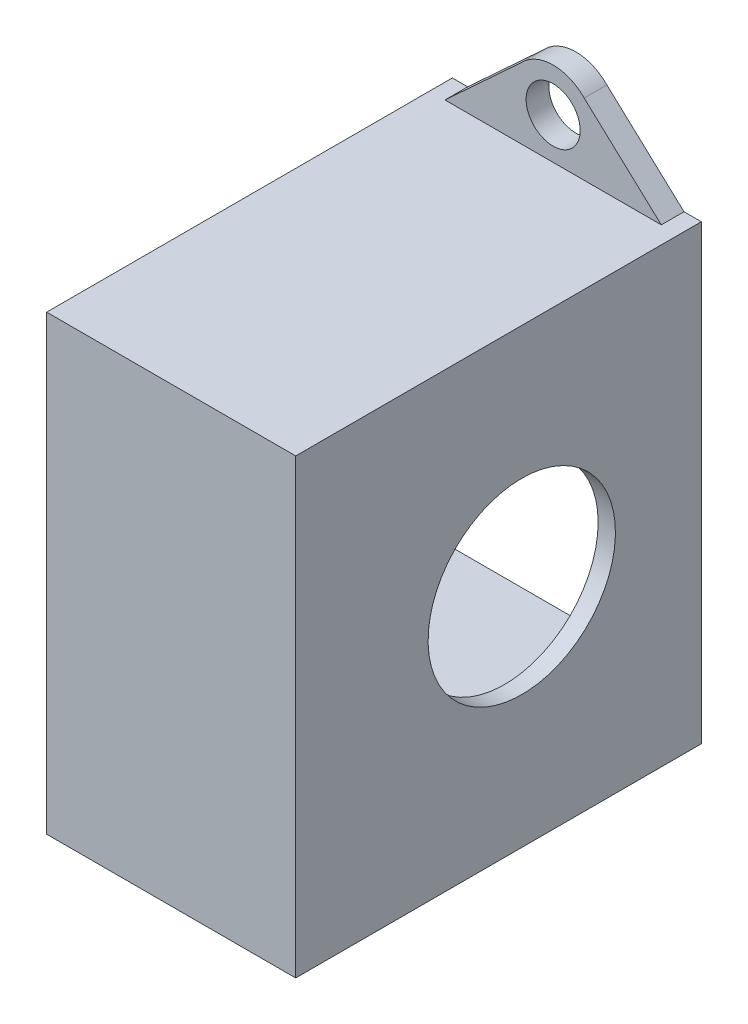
ISO-10303-21;
HEADER;
FILE_DESCRIPTION(('STEP AP214'),'2;1');
FILE_NAME('part.step','',(''),(''),'','','');
FILE_SCHEMA(('AUTOMOTIVE_DESIGN { 1 0 10303 214 1 1 1 1 }'));
ENDSEC;
DATA;
#1=APPLICATION_CONTEXT('core data for automotive mechanical design processes');
#2=APPLICATION_PROTOCOL_DEFINITION('international standard','automotive_design',2000,#1);
#3=PRODUCT_CONTEXT('',#1,'mechanical');
#4=PRODUCT('Part','Part','',(#3));
#5=PRODUCT_RELATED_PRODUCT_CATEGORY('part','',(#4));
#6=PRODUCT_DEFINITION_FORMATION('','',#4);
#7=PRODUCT_DEFINITION_CONTEXT('part definition',#1,'design');
#8=PRODUCT_DEFINITION('design','',#6,#7);
#9=PRODUCT_DEFINITION_SHAPE('','',#8);
#10=(LENGTH_UNIT() NAMED_UNIT(*) SI_UNIT(.MILLI.,.METRE.));
#11=(NAMED_UNIT(*) PLANE_ANGLE_UNIT() SI_UNIT($,.RADIAN.));
#12=(NAMED_UNIT(*) SI_UNIT($,.STERADIAN.) SOLID_ANGLE_UNIT());
#13=UNCERTAINTY_MEASURE_WITH_UNIT(LENGTH_MEASURE(1.E-05),#10,'distance_accuracy_value','');
#14=(GEOMETRIC_REPRESENTATION_CONTEXT(3) GLOBAL_UNCERTAINTY_ASSIGNED_CONTEXT((#13)) GLOBAL_UNIT_ASSIGNED_CONTEXT((#10,
#11,#12)) REPRESENTATION_CONTEXT('',''));
#15=CARTESIAN_POINT('',(0.,0.,0.));
#16=DIRECTION('',(0.,0.,1.));
#17=DIRECTION('',(1.,0.,0.));
#18=AXIS2_PLACEMENT_3D('',#15,#16,#17);
#19=CARTESIAN_POINT('',(-743.540723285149,404.269107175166,5.334));
#20=DIRECTION('',(0.,-1.,0.));
#21=DIRECTION('',(0.,0.,-1.));
#22=AXIS2_PLACEMENT_3D('',#19,#20,#21);
#23=PLANE('',#22);
#24=DIRECTION('',(-1.,0.,0.));
#25=VECTOR('',#24,1.);
#26=CARTESIAN_POINT('',(-743.540723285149,404.269107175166,5.334));
#27=LINE('',#26,#25);
#28=CARTESIAN_POINT('',(-741.508723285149,404.269107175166,5.334));
#29=VERTEX_POINT('',#28);
#30=CARTESIAN_POINT('',(-770.747609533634,404.269107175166,5.334));
#31=VERTEX_POINT('',#30);
#32=EDGE_CURVE('E148',#29,#31,#27,.T.);
#33=ORIENTED_EDGE('',*,*,#32,.F.);
#34=DIRECTION('',(0.,0.,1.));
#35=VECTOR('',#34,1.);
#36=CARTESIAN_POINT('',(-741.508723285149,404.269107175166,5.334));
#37=LINE('',#36,#35);
#38=CARTESIAN_POINT('',(-741.508723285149,404.269107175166,-42.2909999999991));
#39=VERTEX_POINT('',#38);
#40=EDGE_CURVE('E152',#39,#29,#37,.T.);
#41=ORIENTED_EDGE('',*,*,#40,.F.);
#42=DIRECTION('',(-1.,0.,0.));
#43=VECTOR('',#42,1.);
#44=CARTESIAN_POINT('',(-670.190674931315,404.269107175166,-42.2909999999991));
#45=LINE('',#44,#43);
#46=CARTESIAN_POINT('',(-743.540723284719,404.269107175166,-42.2909999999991));
#47=VERTEX_POINT('',#46);
#48=EDGE_CURVE('E186',#39,#47,#45,.T.);
#49=ORIENTED_EDGE('',*,*,#48,.T.);
#50=DIRECTION('',(0.,0.,-1.));
#51=VECTOR('',#50,1.);
#52=CARTESIAN_POINT('',(-743.540723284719,404.269107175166,-39.6239999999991));
#53=LINE('',#52,#51);
#54=CARTESIAN_POINT('',(-743.540723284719,404.269107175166,-39.6239999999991));
#55=VERTEX_POINT('',#54);
#56=EDGE_CURVE('E259',#55,#47,#53,.T.);
#57=ORIENTED_EDGE('',*,*,#56,.F.);
#58=DIRECTION('',(-1.,0.,0.));
#59=VECTOR('',#58,1.);
#60=CARTESIAN_POINT('',(-743.540723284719,404.269107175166,-39.6239999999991));
#61=LINE('',#60,#59);
#62=CARTESIAN_POINT('',(-768.94072328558,404.269107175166,-39.6239999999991));
#63=VERTEX_POINT('',#62);
#64=EDGE_CURVE('E277',#55,#63,#61,.T.);
#65=ORIENTED_EDGE('',*,*,#64,.T.);
#66=DIRECTION('',(0.,0.,-1.));
#67=VECTOR('',#66,1.);
#68=CARTESIAN_POINT('',(-768.94072328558,404.269107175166,-39.6239999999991));
#69=LINE('',#68,#67);
#70=CARTESIAN_POINT('',(-768.94072328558,404.269107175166,-42.2909999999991));
#71=VERTEX_POINT('',#70);
#72=EDGE_CURVE('E255',#63,#71,#69,.T.);
#73=ORIENTED_EDGE('',*,*,#72,.T.);
#74=DIRECTION('',(-1.,0.,0.));
#75=VECTOR('',#74,1.);
#76=CARTESIAN_POINT('',(-770.747609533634,404.269107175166,-42.2909999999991));
#77=LINE('',#76,#75);
#78=CARTESIAN_POINT('',(-770.747609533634,404.269107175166,-42.2909999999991));
#79=VERTEX_POINT('',#78);
#80=EDGE_CURVE('E243',#71,#79,#77,.T.);
#81=ORIENTED_EDGE('',*,*,#80,.T.);
#82=DIRECTION('',(0.,0.,-1.));
#83=VECTOR('',#82,1.);
#84=CARTESIAN_POINT('',(-770.747609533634,404.269107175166,5.334));
#85=LINE('',#84,#83);
#86=EDGE_CURVE('E155',#31,#79,#85,.T.);
#87=ORIENTED_EDGE('',*,*,#86,.F.);
#88=EDGE_LOOP('',(#33,#41,#49,#57,#65,#73,#81,#87));
#89=FACE_BOUND('',#88,.T.);
#90=ADVANCED_FACE('F33',(#89),#23,.F.);
#91=CARTESIAN_POINT('',(-770.747609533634,404.269107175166,5.334));
#92=DIRECTION('',(1.,0.,0.));
#93=DIRECTION('',(0.,0.,-1.));
#94=AXIS2_PLACEMENT_3D('',#91,#92,#93);
#95=PLANE('',#94);
#96=DIRECTION('',(0.,-1.,0.));
#97=VECTOR('',#96,1.);
#98=CARTESIAN_POINT('',(-770.747609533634,404.269107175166,0.));
#99=LINE('',#98,#97);
#100=CARTESIAN_POINT('',(-770.747609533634,398.935107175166,0.));
#101=VERTEX_POINT('',#100);
#102=CARTESIAN_POINT('',(-770.747609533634,356.517107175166,0.));
#103=VERTEX_POINT('',#102);
#104=EDGE_CURVE('E371',#101,#103,#99,.T.);
#105=ORIENTED_EDGE('',*,*,#104,.T.);
#106=DIRECTION('',(0.,0.,1.));
#107=VECTOR('',#106,1.);
#108=CARTESIAN_POINT('',(-770.747609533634,356.517107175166,5.334));
#109=LINE('',#108,#107);
#110=CARTESIAN_POINT('',(-770.747609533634,356.517107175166,-42.2909999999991));
#111=VERTEX_POINT('',#110);
#112=EDGE_CURVE('E288',#111,#103,#109,.T.);
#113=ORIENTED_EDGE('',*,*,#112,.F.);
#114=DIRECTION('',(0.,-1.,0.));
#115=VECTOR('',#114,1.);
#116=CARTESIAN_POINT('',(-770.747609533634,356.517107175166,-42.2909999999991));
#117=LINE('',#116,#115);
#118=CARTESIAN_POINT('',(-770.747609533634,351.183107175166,-42.2909999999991));
#119=VERTEX_POINT('',#118);
#120=EDGE_CURVE('E281',#111,#119,#117,.T.);
#121=ORIENTED_EDGE('',*,*,#120,.T.);
#122=DIRECTION('',(0.,0.,-1.));
#123=VECTOR('',#122,1.);
#124=CARTESIAN_POINT('',(-770.747609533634,351.183107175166,5.334));
#125=LINE('',#124,#123);
#126=CARTESIAN_POINT('',(-770.747609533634,351.183107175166,5.334));
#127=VERTEX_POINT('',#126);
#128=EDGE_CURVE('E158',#127,#119,#125,.T.);
#129=ORIENTED_EDGE('',*,*,#128,.F.);
#130=DIRECTION('',(0.,-1.,0.));
#131=VECTOR('',#130,1.);
#132=CARTESIAN_POINT('',(-770.747609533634,404.269107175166,5.334));
#133=LINE('',#132,#131);
#134=EDGE_CURVE('E159',#31,#127,#133,.T.);
#135=ORIENTED_EDGE('',*,*,#134,.F.);
#136=ORIENTED_EDGE('',*,*,#86,.T.);
#137=DIRECTION('',(0.,1.,0.));
#138=VECTOR('',#137,1.);
#139=CARTESIAN_POINT('',(-770.747609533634,398.935107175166,-42.2909999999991));
#140=LINE('',#139,#138);
#141=CARTESIAN_POINT('',(-770.747609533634,398.935107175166,-42.2909999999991));
#142=VERTEX_POINT('',#141);
#143=EDGE_CURVE('E225',#142,#79,#140,.T.);
#144=ORIENTED_EDGE('',*,*,#143,.F.);
#145=DIRECTION('',(0.,0.,1.));
#146=VECTOR('',#145,1.);
#147=CARTESIAN_POINT('',(-770.747609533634,398.935107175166,5.334));
#148=LINE('',#147,#146);
#149=EDGE_CURVE('E232',#142,#101,#148,.T.);
#150=ORIENTED_EDGE('',*,*,#149,.T.);
#151=EDGE_LOOP('',(#105,#113,#121,#129,#135,#136,#144,#150));
#152=FACE_BOUND('',#151,.T.);
#153=ADVANCED_FACE('F343',(#152),#95,.F.);
#154=CARTESIAN_POINT('',(-743.540723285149,351.183107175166,5.334));
#155=DIRECTION('',(0.,-1.,0.));
#156=DIRECTION('',(0.,0.,-1.));
#157=AXIS2_PLACEMENT_3D('',#154,#155,#156);
#158=PLANE('',#157);
#159=DIRECTION('',(0.,0.,-1.));
#160=VECTOR('',#159,1.);
#161=CARTESIAN_POINT('',(-768.94072328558,351.183107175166,-39.6239999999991));
#162=LINE('',#161,#160);
#163=CARTESIAN_POINT('',(-768.94072328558,351.183107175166,-39.6239999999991));
#164=VERTEX_POINT('',#163);
#165=CARTESIAN_POINT('',(-768.94072328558,351.183107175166,-42.2909999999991));
#166=VERTEX_POINT('',#165);
#167=EDGE_CURVE('E213',#164,#166,#162,.T.);
#168=ORIENTED_EDGE('',*,*,#167,.F.);
#169=DIRECTION('',(-1.,0.,0.));
#170=VECTOR('',#169,1.);
#171=CARTESIAN_POINT('',(-743.540723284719,351.183107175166,-39.6239999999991));
#172=LINE('',#171,#170);
#173=CARTESIAN_POINT('',(-743.540723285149,351.183107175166,-39.6239999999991));
#174=VERTEX_POINT('',#173);
#175=EDGE_CURVE('E50',#174,#164,#172,.T.);
#176=ORIENTED_EDGE('',*,*,#175,.F.);
#177=DIRECTION('',(0.,0.,-1.));
#178=VECTOR('',#177,1.);
#179=CARTESIAN_POINT('',(-743.540723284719,351.183107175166,-39.6239999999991));
#180=LINE('',#179,#178);
#181=CARTESIAN_POINT('',(-743.540723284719,351.183107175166,-42.2909999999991));
#182=VERTEX_POINT('',#181);
#183=EDGE_CURVE('E216',#174,#182,#180,.T.);
#184=ORIENTED_EDGE('',*,*,#183,.T.);
#185=DIRECTION('',(-1.,0.,0.));
#186=VECTOR('',#185,1.);
#187=CARTESIAN_POINT('',(-670.190674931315,351.183107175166,-42.2909999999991));
#188=LINE('',#187,#186);
#189=CARTESIAN_POINT('',(-741.508723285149,351.183107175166,-42.2909999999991));
#190=VERTEX_POINT('',#189);
#191=EDGE_CURVE('E198',#190,#182,#188,.T.);
#192=ORIENTED_EDGE('',*,*,#191,.F.);
#193=DIRECTION('',(0.,0.,-1.));
#194=VECTOR('',#193,1.);
#195=CARTESIAN_POINT('',(-741.508723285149,351.183107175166,5.334));
#196=LINE('',#195,#194);
#197=CARTESIAN_POINT('',(-741.508723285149,351.183107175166,5.334));
#198=VERTEX_POINT('',#197);
#199=EDGE_CURVE('E170',#198,#190,#196,.T.);
#200=ORIENTED_EDGE('',*,*,#199,.F.);
#201=DIRECTION('',(-1.,0.,0.));
#202=VECTOR('',#201,1.);
#203=CARTESIAN_POINT('',(-743.540723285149,351.183107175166,5.334));
#204=LINE('',#203,#202);
#205=EDGE_CURVE('E165',#198,#127,#204,.T.);
#206=ORIENTED_EDGE('',*,*,#205,.T.);
#207=ORIENTED_EDGE('',*,*,#128,.T.);
#208=DIRECTION('',(-1.,0.,0.));
#209=VECTOR('',#208,1.);
#210=CARTESIAN_POINT('',(-770.747609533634,351.183107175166,-42.2909999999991));
#211=LINE('',#210,#209);
#212=EDGE_CURVE('E56',#166,#119,#211,.T.);
#213=ORIENTED_EDGE('',*,*,#212,.F.);
#214=EDGE_LOOP('',(#168,#176,#184,#192,#200,#206,#207,#213));
#215=FACE_BOUND('',#214,.T.);
#216=ADVANCED_FACE('F35',(#215),#158,.T.);
#217=CARTESIAN_POINT('',(0.,0.,5.334));
#218=DIRECTION('',(0.,0.,-1.));
#219=DIRECTION('',(-1.,0.,0.));
#220=AXIS2_PLACEMENT_3D('',#217,#218,#219);
#221=PLANE('',#220);
#222=ORIENTED_EDGE('',*,*,#134,.T.);
#223=ORIENTED_EDGE('',*,*,#205,.F.);
#224=DIRECTION('',(0.,-1.,0.));
#225=VECTOR('',#224,1.);
#226=CARTESIAN_POINT('',(-741.508723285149,404.269107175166,5.334));
#227=LINE('',#226,#225);
#228=EDGE_CURVE('E162',#29,#198,#227,.T.);
#229=ORIENTED_EDGE('',*,*,#228,.F.);
#230=ORIENTED_EDGE('',*,*,#32,.T.);
#231=EDGE_LOOP('',(#222,#223,#229,#230));
#232=FACE_BOUND('',#231,.T.);
#233=ADVANCED_FACE('F163',(#232),#221,.F.);
#234=CARTESIAN_POINT('',(0.,0.,0.));
#235=DIRECTION('',(0.,0.,-1.));
#236=DIRECTION('',(-1.,0.,0.));
#237=AXIS2_PLACEMENT_3D('',#234,#235,#236);
#238=PLANE('',#237);
#239=DIRECTION('',(1.,0.,0.));
#240=VECTOR('',#239,1.);
#241=CARTESIAN_POINT('',(0.,356.517107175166,0.));
#242=LINE('',#241,#240);
#243=CARTESIAN_POINT('',(-743.540723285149,356.517107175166,0.));
#244=VERTEX_POINT('',#243);
#245=EDGE_CURVE('E11',#103,#244,#242,.T.);
#246=ORIENTED_EDGE('',*,*,#245,.F.);
#247=ORIENTED_EDGE('',*,*,#104,.F.);
#248=DIRECTION('',(-1.,0.,0.));
#249=VECTOR('',#248,1.);
#250=CARTESIAN_POINT('',(0.,398.935107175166,0.));
#251=LINE('',#250,#249);
#252=CARTESIAN_POINT('',(-743.540723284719,398.935107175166,0.));
#253=VERTEX_POINT('',#252);
#254=EDGE_CURVE('E42',#253,#101,#251,.T.);
#255=ORIENTED_EDGE('',*,*,#254,.F.);
#256=DIRECTION('',(0.,-1.,0.));
#257=VECTOR('',#256,1.);
#258=CARTESIAN_POINT('',(-743.540723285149,404.269107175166,0.));
#259=LINE('',#258,#257);
#260=EDGE_CURVE('E369',#253,#244,#259,.T.);
#261=ORIENTED_EDGE('',*,*,#260,.T.);
#262=EDGE_LOOP('',(#246,#247,#255,#261));
#263=FACE_BOUND('',#262,.T.);
#264=ADVANCED_FACE('F350',(#263),#238,.T.);
#265=CARTESIAN_POINT('',(-770.747609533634,398.935107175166,-42.2909999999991));
#266=DIRECTION('',(0.,0.,-1.));
#267=DIRECTION('',(-1.,0.,0.));
#268=AXIS2_PLACEMENT_3D('',#265,#266,#267);
#269=PLANE('',#268);
#270=ORIENTED_EDGE('',*,*,#80,.F.);
#271=DIRECTION('',(0.734570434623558,0.678532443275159,0.));
#272=VECTOR('',#271,1.);
#273=CARTESIAN_POINT('',(-768.94072328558,404.269107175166,-42.2909999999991));
#274=LINE('',#273,#272);
#275=CARTESIAN_POINT('',(-759.887506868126,412.631683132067,-42.2909999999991));
#276=VERTEX_POINT('',#275);
#277=EDGE_CURVE('E248',#71,#276,#274,.T.);
#278=ORIENTED_EDGE('',*,*,#277,.T.);
#279=CARTESIAN_POINT('',(-756.240723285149,409.095107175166,-42.2909999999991));
#280=DIRECTION('',(0.,0.,-1.));
#281=DIRECTION('',(1.,0.,0.));
#282=AXIS2_PLACEMENT_3D('',#279,#280,#281);
#283=CIRCLE('',#282,5.08000000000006);
#284=CARTESIAN_POINT('',(-752.593939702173,412.631683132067,-42.2909999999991));
#285=VERTEX_POINT('',#284);
#286=EDGE_CURVE('E251',#276,#285,#283,.T.);
#287=ORIENTED_EDGE('',*,*,#286,.T.);
#288=DIRECTION('',(0.734570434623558,-0.678532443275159,0.));
#289=VECTOR('',#288,1.);
#290=CARTESIAN_POINT('',(-743.540723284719,404.269107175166,-42.2909999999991));
#291=LINE('',#290,#289);
#292=EDGE_CURVE('E252',#285,#47,#291,.T.);
#293=ORIENTED_EDGE('',*,*,#292,.T.);
#294=ORIENTED_EDGE('',*,*,#48,.F.);
#295=DIRECTION('',(0.,1.,0.));
#296=VECTOR('',#295,1.);
#297=CARTESIAN_POINT('',(-741.508723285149,404.269107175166,-42.2909999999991));
#298=LINE('',#297,#296);
#299=EDGE_CURVE('E173',#190,#39,#298,.T.);
#300=ORIENTED_EDGE('',*,*,#299,.F.);
#301=ORIENTED_EDGE('',*,*,#191,.T.);
#302=DIRECTION('',(0.734570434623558,0.678532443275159,0.));
#303=VECTOR('',#302,1.);
#304=CARTESIAN_POINT('',(-743.540723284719,351.183107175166,-42.2909999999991));
#305=LINE('',#304,#303);
#306=CARTESIAN_POINT('',(-752.593939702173,342.820531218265,-42.2909999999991));
#307=VERTEX_POINT('',#306);
#308=EDGE_CURVE('E194',#307,#182,#305,.T.);
#309=ORIENTED_EDGE('',*,*,#308,.F.);
#310=CARTESIAN_POINT('',(-756.240723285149,346.357107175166,-42.2909999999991));
#311=DIRECTION('',(0.,0.,1.));
#312=DIRECTION('',(1.,0.,0.));
#313=AXIS2_PLACEMENT_3D('',#310,#311,#312);
#314=CIRCLE('',#313,5.08000000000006);
#315=CARTESIAN_POINT('',(-759.887506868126,342.820531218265,-42.2909999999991));
#316=VERTEX_POINT('',#315);
#317=EDGE_CURVE('E205',#316,#307,#314,.T.);
#318=ORIENTED_EDGE('',*,*,#317,.F.);
#319=DIRECTION('',(0.734570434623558,-0.678532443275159,0.));
#320=VECTOR('',#319,1.);
#321=CARTESIAN_POINT('',(-768.94072328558,351.183107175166,-42.2909999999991));
#322=LINE('',#321,#320);
#323=EDGE_CURVE('E207',#166,#316,#322,.T.);
#324=ORIENTED_EDGE('',*,*,#323,.F.);
#325=ORIENTED_EDGE('',*,*,#212,.T.);
#326=ORIENTED_EDGE('',*,*,#120,.F.);
#327=DIRECTION('',(-1.,0.,0.));
#328=VECTOR('',#327,1.);
#329=CARTESIAN_POINT('',(-770.747609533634,356.517107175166,-42.2909999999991));
#330=LINE('',#329,#328);
#331=CARTESIAN_POINT('',(-743.540723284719,356.517107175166,-42.2909999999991));
#332=VERTEX_POINT('',#331);
#333=EDGE_CURVE('E384',#332,#111,#330,.T.);
#334=ORIENTED_EDGE('',*,*,#333,.F.);
#335=DIRECTION('',(0.,1.,0.));
#336=VECTOR('',#335,1.);
#337=CARTESIAN_POINT('',(-743.540723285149,404.269107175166,-42.2909999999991));
#338=LINE('',#337,#336);
#339=CARTESIAN_POINT('',(-743.540723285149,398.935107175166,-42.2909999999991));
#340=VERTEX_POINT('',#339);
#341=EDGE_CURVE('E183',#332,#340,#338,.T.);
#342=ORIENTED_EDGE('',*,*,#341,.T.);
#343=DIRECTION('',(-1.,0.,0.));
#344=VECTOR('',#343,1.);
#345=CARTESIAN_POINT('',(-770.747609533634,398.935107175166,-42.2909999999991));
#346=LINE('',#345,#344);
#347=EDGE_CURVE('E222',#340,#142,#346,.T.);
#348=ORIENTED_EDGE('',*,*,#347,.T.);
#349=ORIENTED_EDGE('',*,*,#143,.T.);
#350=EDGE_LOOP('',(#270,#278,#287,#293,#294,#300,#301,#309,#318,#324,#325,#326,#334,#342,#348,#349));
#351=FACE_BOUND('',#350,.T.);
#352=CARTESIAN_POINT('',(-756.240723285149,409.095107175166,-42.2909999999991));
#353=DIRECTION('',(0.,0.,-1.));
#354=DIRECTION('',(-1.,0.,0.));
#355=AXIS2_PLACEMENT_3D('',#352,#353,#354);
#356=CIRCLE('',#355,3.17500000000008);
#357=CARTESIAN_POINT('',(-759.41572328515,409.095107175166,-42.2909999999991));
#358=VERTEX_POINT('',#357);
#359=EDGE_CURVE('E278',#358,#358,#356,.T.);
#360=ORIENTED_EDGE('',*,*,#359,.F.);
#361=EDGE_LOOP('',(#360));
#362=FACE_BOUND('',#361,.T.);
#363=CARTESIAN_POINT('',(-756.240723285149,346.357107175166,-42.2909999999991));
#364=DIRECTION('',(0.,0.,1.));
#365=DIRECTION('',(-1.,0.,0.));
#366=AXIS2_PLACEMENT_3D('',#363,#364,#365);
#367=CIRCLE('',#366,3.17500000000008);
#368=CARTESIAN_POINT('',(-759.41572328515,346.357107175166,-42.2909999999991));
#369=VERTEX_POINT('',#368);
#370=EDGE_CURVE('E195',#369,#369,#367,.T.);
#371=ORIENTED_EDGE('',*,*,#370,.T.);
#372=EDGE_LOOP('',(#371));
#373=FACE_BOUND('',#372,.T.);
#374=ADVANCED_FACE('F306',(#351,#362,#373),#269,.T.);
#375=CARTESIAN_POINT('',(0.,398.935107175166,0.));
#376=DIRECTION('',(0.,-1.,0.));
#377=DIRECTION('',(0.,0.,-1.));
#378=AXIS2_PLACEMENT_3D('',#375,#376,#377);
#379=PLANE('',#378);
#380=DIRECTION('',(0.,0.,-1.));
#381=VECTOR('',#380,1.);
#382=CARTESIAN_POINT('',(-743.540723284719,398.935107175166,5.334));
#383=LINE('',#382,#381);
#384=EDGE_CURVE('E226',#253,#340,#383,.T.);
#385=ORIENTED_EDGE('',*,*,#384,.F.);
#386=ORIENTED_EDGE('',*,*,#254,.T.);
#387=ORIENTED_EDGE('',*,*,#149,.F.);
#388=ORIENTED_EDGE('',*,*,#347,.F.);
#389=EDGE_LOOP('',(#385,#386,#387,#388));
#390=FACE_BOUND('',#389,.T.);
#391=ADVANCED_FACE('F339',(#390),#379,.T.);
#392=CARTESIAN_POINT('',(-743.540723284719,404.269107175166,-39.6239999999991));
#393=DIRECTION('',(0.678532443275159,0.734570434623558,0.));
#394=DIRECTION('',(-0.734570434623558,0.678532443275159,0.));
#395=AXIS2_PLACEMENT_3D('',#392,#393,#394);
#396=PLANE('',#395);
#397=ORIENTED_EDGE('',*,*,#292,.F.);
#398=DIRECTION('',(0.,0.,-1.));
#399=VECTOR('',#398,1.);
#400=CARTESIAN_POINT('',(-752.593939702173,412.631683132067,-39.6239999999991));
#401=LINE('',#400,#399);
#402=CARTESIAN_POINT('',(-752.593939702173,412.631683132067,-39.6239999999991));
#403=VERTEX_POINT('',#402);
#404=EDGE_CURVE('E246',#403,#285,#401,.T.);
#405=ORIENTED_EDGE('',*,*,#404,.F.);
#406=DIRECTION('',(0.734570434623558,-0.678532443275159,0.));
#407=VECTOR('',#406,1.);
#408=CARTESIAN_POINT('',(-743.540723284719,404.269107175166,-39.6239999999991));
#409=LINE('',#408,#407);
#410=EDGE_CURVE('E267',#403,#55,#409,.T.);
#411=ORIENTED_EDGE('',*,*,#410,.T.);
#412=ORIENTED_EDGE('',*,*,#56,.T.);
#413=EDGE_LOOP('',(#397,#405,#411,#412));
#414=FACE_BOUND('',#413,.T.);
#415=ADVANCED_FACE('F314',(#414),#396,.T.);
#416=CARTESIAN_POINT('',(-756.240723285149,409.095107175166,-39.6239999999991));
#417=DIRECTION('',(0.,0.,-1.));
#418=DIRECTION('',(-1.,0.,0.));
#419=AXIS2_PLACEMENT_3D('',#416,#417,#418);
#420=CYLINDRICAL_SURFACE('',#419,5.08000000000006);
#421=ORIENTED_EDGE('',*,*,#286,.F.);
#422=DIRECTION('',(0.,0.,-1.));
#423=VECTOR('',#422,1.);
#424=CARTESIAN_POINT('',(-759.887506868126,412.631683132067,-39.6239999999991));
#425=LINE('',#424,#423);
#426=CARTESIAN_POINT('',(-759.887506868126,412.631683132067,-39.6239999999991));
#427=VERTEX_POINT('',#426);
#428=EDGE_CURVE('E258',#427,#276,#425,.T.);
#429=ORIENTED_EDGE('',*,*,#428,.F.);
#430=CARTESIAN_POINT('',(-756.240723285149,409.095107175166,-39.6239999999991));
#431=DIRECTION('',(0.,0.,-1.));
#432=DIRECTION('',(1.,0.,0.));
#433=AXIS2_PLACEMENT_3D('',#430,#431,#432);
#434=CIRCLE('',#433,5.08000000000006);
#435=EDGE_CURVE('E271',#427,#403,#434,.T.);
#436=ORIENTED_EDGE('',*,*,#435,.T.);
#437=ORIENTED_EDGE('',*,*,#404,.T.);
#438=EDGE_LOOP('',(#421,#429,#436,#437));
#439=FACE_BOUND('',#438,.T.);
#440=ADVANCED_FACE('F331',(#439),#420,.T.);
#441=CARTESIAN_POINT('',(-768.94072328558,404.269107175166,-39.6239999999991));
#442=DIRECTION('',(-0.678532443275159,0.734570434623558,0.));
#443=DIRECTION('',(-0.734570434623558,-0.678532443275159,0.));
#444=AXIS2_PLACEMENT_3D('',#441,#442,#443);
#445=PLANE('',#444);
#446=ORIENTED_EDGE('',*,*,#277,.F.);
#447=ORIENTED_EDGE('',*,*,#72,.F.);
#448=DIRECTION('',(0.734570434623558,0.678532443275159,0.));
#449=VECTOR('',#448,1.);
#450=CARTESIAN_POINT('',(-768.94072328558,404.269107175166,-39.6239999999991));
#451=LINE('',#450,#449);
#452=EDGE_CURVE('E274',#63,#427,#451,.T.);
#453=ORIENTED_EDGE('',*,*,#452,.T.);
#454=ORIENTED_EDGE('',*,*,#428,.T.);
#455=EDGE_LOOP('',(#446,#447,#453,#454));
#456=FACE_BOUND('',#455,.T.);
#457=ADVANCED_FACE('F328',(#456),#445,.T.);
#458=CARTESIAN_POINT('',(-756.240723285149,409.095107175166,-39.6239999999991));
#459=DIRECTION('',(0.,0.,1.));
#460=DIRECTION('',(1.,0.,0.));
#461=AXIS2_PLACEMENT_3D('',#458,#459,#460);
#462=PLANE('',#461);
#463=CARTESIAN_POINT('',(-756.240723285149,409.095107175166,-39.6239999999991));
#464=DIRECTION('',(0.,0.,-1.));
#465=DIRECTION('',(-1.,0.,0.));
#466=AXIS2_PLACEMENT_3D('',#463,#464,#465);
#467=CIRCLE('',#466,3.17500000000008);
#468=CARTESIAN_POINT('',(-759.41572328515,409.095107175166,-39.6239999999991));
#469=VERTEX_POINT('',#468);
#470=EDGE_CURVE('E270',#469,#469,#467,.T.);
#471=ORIENTED_EDGE('',*,*,#470,.T.);
#472=EDGE_LOOP('',(#471));
#473=FACE_BOUND('',#472,.T.);
#474=ORIENTED_EDGE('',*,*,#410,.F.);
#475=ORIENTED_EDGE('',*,*,#435,.F.);
#476=ORIENTED_EDGE('',*,*,#452,.F.);
#477=ORIENTED_EDGE('',*,*,#64,.F.);
#478=EDGE_LOOP('',(#474,#475,#476,#477));
#479=FACE_BOUND('',#478,.T.);
#480=ADVANCED_FACE('F326',(#473,#479),#462,.T.);
#481=CARTESIAN_POINT('',(-756.240723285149,409.095107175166,-39.6239999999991));
#482=DIRECTION('',(0.,0.,-1.));
#483=DIRECTION('',(-1.,0.,0.));
#484=AXIS2_PLACEMENT_3D('',#481,#482,#483);
#485=CYLINDRICAL_SURFACE('',#484,3.17500000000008);
#486=ORIENTED_EDGE('',*,*,#470,.F.);
#487=EDGE_LOOP('',(#486));
#488=FACE_BOUND('',#487,.T.);
#489=ORIENTED_EDGE('',*,*,#359,.T.);
#490=EDGE_LOOP('',(#489));
#491=FACE_BOUND('',#490,.T.);
#492=ADVANCED_FACE('F426',(#488,#491),#485,.F.);
#493=CARTESIAN_POINT('',(0.,356.517107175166,0.));
#494=DIRECTION('',(0.,1.,0.));
#495=DIRECTION('',(0.,0.,-1.));
#496=AXIS2_PLACEMENT_3D('',#493,#494,#495);
#497=PLANE('',#496);
#498=ORIENTED_EDGE('',*,*,#112,.T.);
#499=ORIENTED_EDGE('',*,*,#245,.T.);
#500=DIRECTION('',(0.,0.,-1.));
#501=VECTOR('',#500,1.);
#502=CARTESIAN_POINT('',(-743.540723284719,356.517107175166,5.334));
#503=LINE('',#502,#501);
#504=EDGE_CURVE('E233',#244,#332,#503,.T.);
#505=ORIENTED_EDGE('',*,*,#504,.T.);
#506=ORIENTED_EDGE('',*,*,#333,.T.);
#507=EDGE_LOOP('',(#498,#499,#505,#506));
#508=FACE_BOUND('',#507,.T.);
#509=ADVANCED_FACE('F401',(#508),#497,.T.);
#510=CARTESIAN_POINT('',(-756.240723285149,346.357107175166,-39.6239999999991));
#511=DIRECTION('',(0.,0.,1.));
#512=DIRECTION('',(1.,0.,0.));
#513=AXIS2_PLACEMENT_3D('',#510,#511,#512);
#514=PLANE('',#513);
#515=DIRECTION('',(0.734570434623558,0.678532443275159,0.));
#516=VECTOR('',#515,1.);
#517=CARTESIAN_POINT('',(-743.540723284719,351.183107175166,-39.6239999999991));
#518=LINE('',#517,#516);
#519=CARTESIAN_POINT('',(-752.593939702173,342.820531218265,-39.6239999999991));
#520=VERTEX_POINT('',#519);
#521=EDGE_CURVE('E202',#520,#174,#518,.T.);
#522=ORIENTED_EDGE('',*,*,#521,.T.);
#523=ORIENTED_EDGE('',*,*,#175,.T.);
#524=DIRECTION('',(0.734570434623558,-0.678532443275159,0.));
#525=VECTOR('',#524,1.);
#526=CARTESIAN_POINT('',(-768.94072328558,351.183107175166,-39.6239999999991));
#527=LINE('',#526,#525);
#528=CARTESIAN_POINT('',(-759.887506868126,342.820531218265,-39.6239999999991));
#529=VERTEX_POINT('',#528);
#530=EDGE_CURVE('E201',#164,#529,#527,.T.);
#531=ORIENTED_EDGE('',*,*,#530,.T.);
#532=CARTESIAN_POINT('',(-756.240723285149,346.357107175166,-39.6239999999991));
#533=DIRECTION('',(0.,0.,1.));
#534=DIRECTION('',(1.,0.,0.));
#535=AXIS2_PLACEMENT_3D('',#532,#533,#534);
#536=CIRCLE('',#535,5.08000000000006);
#537=EDGE_CURVE('E199',#529,#520,#536,.T.);
#538=ORIENTED_EDGE('',*,*,#537,.T.);
#539=EDGE_LOOP('',(#522,#523,#531,#538));
#540=FACE_BOUND('',#539,.T.);
#541=CARTESIAN_POINT('',(-756.240723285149,346.357107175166,-39.6239999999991));
#542=DIRECTION('',(0.,0.,1.));
#543=DIRECTION('',(-1.,0.,0.));
#544=AXIS2_PLACEMENT_3D('',#541,#542,#543);
#545=CIRCLE('',#544,3.17500000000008);
#546=CARTESIAN_POINT('',(-759.41572328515,346.357107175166,-39.6239999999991));
#547=VERTEX_POINT('',#546);
#548=EDGE_CURVE('E191',#547,#547,#545,.T.);
#549=ORIENTED_EDGE('',*,*,#548,.F.);
#550=EDGE_LOOP('',(#549));
#551=FACE_BOUND('',#550,.T.);
#552=ADVANCED_FACE('F398',(#540,#551),#514,.T.);
#553=CARTESIAN_POINT('',(-743.540723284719,351.183107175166,-39.6239999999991));
#554=DIRECTION('',(-0.678532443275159,0.734570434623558,0.));
#555=DIRECTION('',(-0.734570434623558,-0.678532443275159,0.));
#556=AXIS2_PLACEMENT_3D('',#553,#554,#555);
#557=PLANE('',#556);
#558=ORIENTED_EDGE('',*,*,#308,.T.);
#559=ORIENTED_EDGE('',*,*,#183,.F.);
#560=ORIENTED_EDGE('',*,*,#521,.F.);
#561=DIRECTION('',(0.,0.,-1.));
#562=VECTOR('',#561,1.);
#563=CARTESIAN_POINT('',(-752.593939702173,342.820531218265,-39.6239999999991));
#564=LINE('',#563,#562);
#565=EDGE_CURVE('E293',#520,#307,#564,.T.);
#566=ORIENTED_EDGE('',*,*,#565,.T.);
#567=EDGE_LOOP('',(#558,#559,#560,#566));
#568=FACE_BOUND('',#567,.T.);
#569=ADVANCED_FACE('F396',(#568),#557,.F.);
#570=CARTESIAN_POINT('',(-768.94072328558,351.183107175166,-39.6239999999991));
#571=DIRECTION('',(0.678532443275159,0.734570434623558,0.));
#572=DIRECTION('',(-0.734570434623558,0.678532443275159,0.));
#573=AXIS2_PLACEMENT_3D('',#570,#571,#572);
#574=PLANE('',#573);
#575=ORIENTED_EDGE('',*,*,#323,.T.);
#576=DIRECTION('',(0.,0.,-1.));
#577=VECTOR('',#576,1.);
#578=CARTESIAN_POINT('',(-759.887506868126,342.820531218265,-39.6239999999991));
#579=LINE('',#578,#577);
#580=EDGE_CURVE('E210',#529,#316,#579,.T.);
#581=ORIENTED_EDGE('',*,*,#580,.F.);
#582=ORIENTED_EDGE('',*,*,#530,.F.);
#583=ORIENTED_EDGE('',*,*,#167,.T.);
#584=EDGE_LOOP('',(#575,#581,#582,#583));
#585=FACE_BOUND('',#584,.T.);
#586=ADVANCED_FACE('F389',(#585),#574,.F.);
#587=CARTESIAN_POINT('',(-756.240723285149,346.357107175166,-39.6239999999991));
#588=DIRECTION('',(0.,0.,-1.));
#589=DIRECTION('',(-1.,0.,0.));
#590=AXIS2_PLACEMENT_3D('',#587,#588,#589);
#591=CYLINDRICAL_SURFACE('',#590,5.08000000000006);
#592=ORIENTED_EDGE('',*,*,#317,.T.);
#593=ORIENTED_EDGE('',*,*,#565,.F.);
#594=ORIENTED_EDGE('',*,*,#537,.F.);
#595=ORIENTED_EDGE('',*,*,#580,.T.);
#596=EDGE_LOOP('',(#592,#593,#594,#595));
#597=FACE_BOUND('',#596,.T.);
#598=ADVANCED_FACE('F393',(#597),#591,.T.);
#599=CARTESIAN_POINT('',(-756.240723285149,346.357107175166,-39.6239999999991));
#600=DIRECTION('',(0.,0.,-1.));
#601=DIRECTION('',(-1.,0.,0.));
#602=AXIS2_PLACEMENT_3D('',#599,#600,#601);
#603=CYLINDRICAL_SURFACE('',#602,3.17500000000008);
#604=ORIENTED_EDGE('',*,*,#548,.T.);
#605=EDGE_LOOP('',(#604));
#606=FACE_BOUND('',#605,.T.);
#607=ORIENTED_EDGE('',*,*,#370,.F.);
#608=EDGE_LOOP('',(#607));
#609=FACE_BOUND('',#608,.T.);
#610=ADVANCED_FACE('F405',(#606,#609),#603,.F.);
#611=CARTESIAN_POINT('',(-743.540723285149,0.,0.));
#612=DIRECTION('',(1.,0.,0.));
#613=DIRECTION('',(0.,0.,-1.));
#614=AXIS2_PLACEMENT_3D('',#611,#612,#613);
#615=PLANE('',#614);
#616=ORIENTED_EDGE('',*,*,#504,.F.);
#617=ORIENTED_EDGE('',*,*,#260,.F.);
#618=ORIENTED_EDGE('',*,*,#384,.T.);
#619=ORIENTED_EDGE('',*,*,#341,.F.);
#620=EDGE_LOOP('',(#616,#617,#618,#619));
#621=FACE_BOUND('',#620,.T.);
#622=CARTESIAN_POINT('',(-743.540723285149,377.726107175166,-21.209));
#623=DIRECTION('',(1.,0.,0.));
#624=DIRECTION('',(0.,0.,-1.));
#625=AXIS2_PLACEMENT_3D('',#622,#623,#624);
#626=CIRCLE('',#625,10.9982);
#627=CARTESIAN_POINT('',(-743.540723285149,377.726107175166,-32.2072));
#628=VERTEX_POINT('',#627);
#629=EDGE_CURVE('E169',#628,#628,#626,.T.);
#630=ORIENTED_EDGE('',*,*,#629,.T.);
#631=EDGE_LOOP('',(#630));
#632=FACE_BOUND('',#631,.T.);
#633=ADVANCED_FACE('F373',(#621,#632),#615,.F.);
#634=CARTESIAN_POINT('',(-670.190674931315,377.726107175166,-21.209));
#635=DIRECTION('',(-1.,0.,0.));
#636=DIRECTION('',(0.,0.,1.));
#637=AXIS2_PLACEMENT_3D('',#634,#635,#636);
#638=CYLINDRICAL_SURFACE('',#637,10.9982);
#639=ORIENTED_EDGE('',*,*,#629,.F.);
#640=EDGE_LOOP('',(#639));
#641=FACE_BOUND('',#640,.T.);
#642=CARTESIAN_POINT('',(-741.508723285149,377.726107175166,-21.209));
#643=DIRECTION('',(1.,0.,0.));
#644=DIRECTION('',(0.,1.,0.));
#645=AXIS2_PLACEMENT_3D('',#642,#643,#644);
#646=CIRCLE('',#645,10.9982);
#647=CARTESIAN_POINT('',(-741.508723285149,388.724307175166,-21.209));
#648=VERTEX_POINT('',#647);
#649=EDGE_CURVE('E174',#648,#648,#646,.T.);
#650=ORIENTED_EDGE('',*,*,#649,.T.);
#651=EDGE_LOOP('',(#650));
#652=FACE_BOUND('',#651,.T.);
#653=ADVANCED_FACE('F415',(#641,#652),#638,.F.);
#654=CARTESIAN_POINT('',(-741.508723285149,377.726107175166,-21.209));
#655=DIRECTION('',(1.,0.,0.));
#656=DIRECTION('',(0.,0.,-1.));
#657=AXIS2_PLACEMENT_3D('',#654,#655,#656);
#658=PLANE('',#657);
#659=ORIENTED_EDGE('',*,*,#649,.F.);
#660=EDGE_LOOP('',(#659));
#661=FACE_BOUND('',#660,.T.);
#662=ORIENTED_EDGE('',*,*,#40,.T.);
#663=ORIENTED_EDGE('',*,*,#228,.T.);
#664=ORIENTED_EDGE('',*,*,#199,.T.);
#665=ORIENTED_EDGE('',*,*,#299,.T.);
#666=EDGE_LOOP('',(#662,#663,#664,#665));
#667=FACE_BOUND('',#666,.T.);
#668=ADVANCED_FACE('F172',(#661,#667),#658,.T.);
#669=CLOSED_SHELL('',(#90,#153,#216,#233,#264,#374,#391,#415,#440,#457,#480,#492,#509,#552,#569,
#586,#598,#610,#633,#653,#668));
#670=MANIFOLD_SOLID_BREP('B2',#669);
#671=ADVANCED_BREP_SHAPE_REPRESENTATION('',(#18,#670),#14);
#672=SHAPE_DEFINITION_REPRESENTATION(#9,#671);
ENDSEC;
END-ISO-10303-21;
